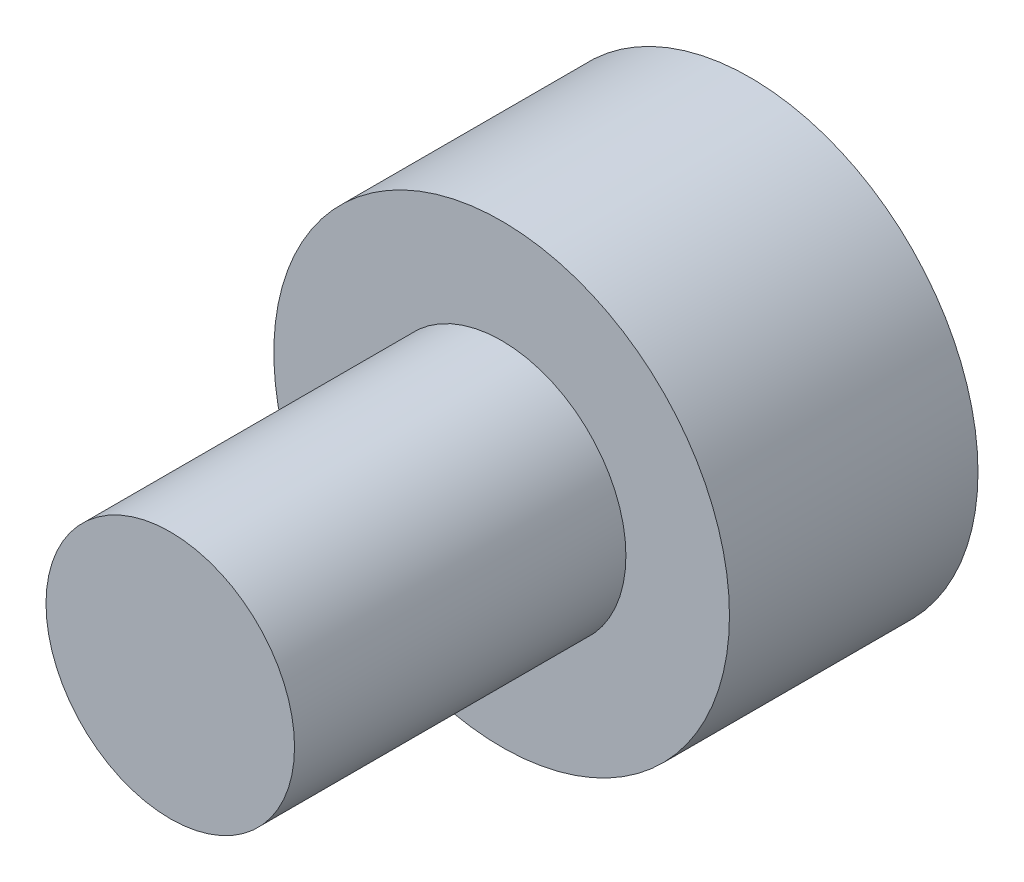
ISO-10303-21;
HEADER;
FILE_DESCRIPTION(('STEP AP214'),'2;1');
FILE_NAME('part.step','',(''),(''),'','','');
FILE_SCHEMA(('AUTOMOTIVE_DESIGN { 1 0 10303 214 1 1 1 1 }'));
ENDSEC;
DATA;
#1=APPLICATION_CONTEXT('core data for automotive mechanical design processes');
#2=APPLICATION_PROTOCOL_DEFINITION('international standard','automotive_design',2000,#1);
#3=PRODUCT_CONTEXT('',#1,'mechanical');
#4=PRODUCT('Part','Part','',(#3));
#5=PRODUCT_RELATED_PRODUCT_CATEGORY('part','',(#4));
#6=PRODUCT_DEFINITION_FORMATION('','',#4);
#7=PRODUCT_DEFINITION_CONTEXT('part definition',#1,'design');
#8=PRODUCT_DEFINITION('design','',#6,#7);
#9=PRODUCT_DEFINITION_SHAPE('','',#8);
#10=(LENGTH_UNIT() NAMED_UNIT(*) SI_UNIT(.MILLI.,.METRE.));
#11=(NAMED_UNIT(*) PLANE_ANGLE_UNIT() SI_UNIT($,.RADIAN.));
#12=(NAMED_UNIT(*) SI_UNIT($,.STERADIAN.) SOLID_ANGLE_UNIT());
#13=UNCERTAINTY_MEASURE_WITH_UNIT(LENGTH_MEASURE(1.E-05),#10,'distance_accuracy_value','');
#14=(GEOMETRIC_REPRESENTATION_CONTEXT(3) GLOBAL_UNCERTAINTY_ASSIGNED_CONTEXT((#13)) GLOBAL_UNIT_ASSIGNED_CONTEXT((#10,
#11,#12)) REPRESENTATION_CONTEXT('',''));
#15=CARTESIAN_POINT('',(0.,0.,0.));
#16=DIRECTION('',(0.,0.,1.));
#17=DIRECTION('',(1.,0.,0.));
#18=AXIS2_PLACEMENT_3D('',#15,#16,#17);
#19=CARTESIAN_POINT('',(0.,-48.5,-10.3));
#20=DIRECTION('',(0.,0.,1.));
#21=DIRECTION('',(0.,-1.,0.));
#22=AXIS2_PLACEMENT_3D('',#19,#20,#21);
#23=PLANE('',#22);
#24=CARTESIAN_POINT('',(0.,-48.5,-10.3));
#25=DIRECTION('',(0.,0.,1.));
#26=DIRECTION('',(1.,0.,0.));
#27=AXIS2_PLACEMENT_3D('',#24,#25,#26);
#28=CIRCLE('',#27,1.5);
#29=CARTESIAN_POINT('',(1.5,-48.5,-10.3));
#30=VERTEX_POINT('',#29);
#31=EDGE_CURVE('E20',#30,#30,#28,.T.);
#32=ORIENTED_EDGE('',*,*,#31,.T.);
#33=EDGE_LOOP('',(#32));
#34=FACE_BOUND('',#33,.T.);
#35=ADVANCED_FACE('F16',(#34),#23,.T.);
#36=CARTESIAN_POINT('',(0.,-48.5,-14.3));
#37=DIRECTION('',(0.,0.,1.));
#38=DIRECTION('',(1.,0.,0.));
#39=AXIS2_PLACEMENT_3D('',#36,#37,#38);
#40=CYLINDRICAL_SURFACE('',#39,1.5);
#41=ORIENTED_EDGE('',*,*,#31,.F.);
#42=DIRECTION('',(0.,0.,1.));
#43=VECTOR('',#42,1.);
#44=CARTESIAN_POINT('',(1.5,-48.5,-14.3));
#45=LINE('',#44,#43);
#46=CARTESIAN_POINT('',(1.5,-48.5,-14.3));
#47=VERTEX_POINT('',#46);
#48=EDGE_CURVE('E10',#47,#30,#45,.T.);
#49=ORIENTED_EDGE('',*,*,#48,.F.);
#50=CARTESIAN_POINT('',(0.,-48.5,-14.3));
#51=DIRECTION('',(0.,0.,1.));
#52=DIRECTION('',(1.,0.,0.));
#53=AXIS2_PLACEMENT_3D('',#50,#51,#52);
#54=CIRCLE('',#53,1.5);
#55=EDGE_CURVE('E64',#47,#47,#54,.T.);
#56=ORIENTED_EDGE('',*,*,#55,.T.);
#57=ORIENTED_EDGE('',*,*,#48,.T.);
#58=EDGE_LOOP('',(#41,#49,#56,#57));
#59=FACE_BOUND('',#58,.T.);
#60=ADVANCED_FACE('F81',(#59),#40,.T.);
#61=CARTESIAN_POINT('',(0.,-48.5,-17.3));
#62=DIRECTION('',(0.,0.,1.));
#63=DIRECTION('',(0.,-1.,0.));
#64=AXIS2_PLACEMENT_3D('',#61,#62,#63);
#65=PLANE('',#64);
#66=CARTESIAN_POINT('',(0.,-48.5,-17.3));
#67=DIRECTION('',(0.,0.,1.));
#68=DIRECTION('',(1.,0.,0.));
#69=AXIS2_PLACEMENT_3D('',#66,#67,#68);
#70=CIRCLE('',#69,2.75);
#71=CARTESIAN_POINT('',(2.75,-48.5,-17.3));
#72=VERTEX_POINT('',#71);
#73=EDGE_CURVE('E56',#72,#72,#70,.T.);
#74=ORIENTED_EDGE('',*,*,#73,.F.);
#75=EDGE_LOOP('',(#74));
#76=FACE_BOUND('',#75,.T.);
#77=ADVANCED_FACE('F76',(#76),#65,.F.);
#78=CARTESIAN_POINT('',(0.,-48.5,-14.3));
#79=DIRECTION('',(0.,0.,1.));
#80=DIRECTION('',(0.,-1.,0.));
#81=AXIS2_PLACEMENT_3D('',#78,#79,#80);
#82=PLANE('',#81);
#83=ORIENTED_EDGE('',*,*,#55,.F.);
#84=EDGE_LOOP('',(#83));
#85=FACE_BOUND('',#84,.T.);
#86=CARTESIAN_POINT('',(0.,-48.5,-14.3));
#87=DIRECTION('',(0.,0.,1.));
#88=DIRECTION('',(1.,0.,0.));
#89=AXIS2_PLACEMENT_3D('',#86,#87,#88);
#90=CIRCLE('',#89,2.75);
#91=CARTESIAN_POINT('',(2.75,-48.5,-14.3));
#92=VERTEX_POINT('',#91);
#93=EDGE_CURVE('E54',#92,#92,#90,.T.);
#94=ORIENTED_EDGE('',*,*,#93,.T.);
#95=EDGE_LOOP('',(#94));
#96=FACE_BOUND('',#95,.T.);
#97=ADVANCED_FACE('F18',(#85,#96),#82,.T.);
#98=CARTESIAN_POINT('',(0.,-48.5,-17.3));
#99=DIRECTION('',(0.,0.,1.));
#100=DIRECTION('',(1.,0.,0.));
#101=AXIS2_PLACEMENT_3D('',#98,#99,#100);
#102=CYLINDRICAL_SURFACE('',#101,2.75);
#103=ORIENTED_EDGE('',*,*,#93,.F.);
#104=DIRECTION('',(0.,0.,1.));
#105=VECTOR('',#104,1.);
#106=CARTESIAN_POINT('',(2.75,-48.5,-17.3));
#107=LINE('',#106,#105);
#108=EDGE_CURVE('E51',#72,#92,#107,.T.);
#109=ORIENTED_EDGE('',*,*,#108,.F.);
#110=ORIENTED_EDGE('',*,*,#73,.T.);
#111=ORIENTED_EDGE('',*,*,#108,.T.);
#112=EDGE_LOOP('',(#103,#109,#110,#111));
#113=FACE_BOUND('',#112,.T.);
#114=ADVANCED_FACE('F53',(#113),#102,.T.);
#115=CLOSED_SHELL('',(#35,#60,#77,#97,#114));
#116=MANIFOLD_SOLID_BREP('B1',#115);
#117=ADVANCED_BREP_SHAPE_REPRESENTATION('',(#18,#116),#14);
#118=SHAPE_DEFINITION_REPRESENTATION(#9,#117);
ENDSEC;
END-ISO-10303-21;
